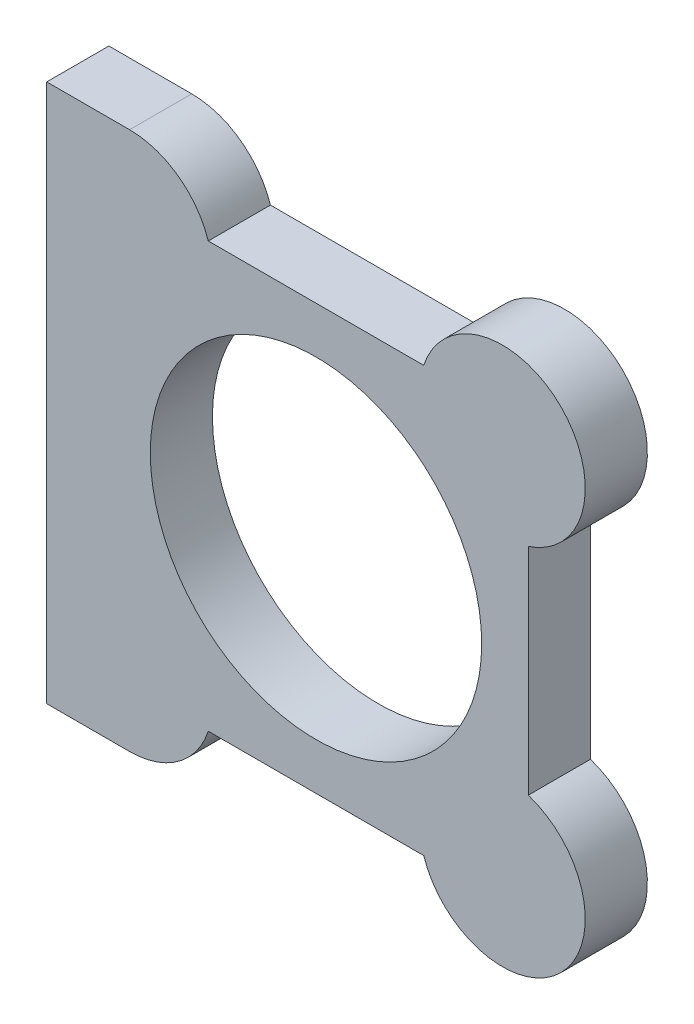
ISO-10303-21;
HEADER;
FILE_DESCRIPTION(('STEP AP214'),'2;1');
FILE_NAME('part.step','',(''),(''),'','','');
FILE_SCHEMA(('AUTOMOTIVE_DESIGN { 1 0 10303 214 1 1 1 1 }'));
ENDSEC;
DATA;
#1=APPLICATION_CONTEXT('core data for automotive mechanical design processes');
#2=APPLICATION_PROTOCOL_DEFINITION('international standard','automotive_design',2000,#1);
#3=PRODUCT_CONTEXT('',#1,'mechanical');
#4=PRODUCT('Part','Part','',(#3));
#5=PRODUCT_RELATED_PRODUCT_CATEGORY('part','',(#4));
#6=PRODUCT_DEFINITION_FORMATION('','',#4);
#7=PRODUCT_DEFINITION_CONTEXT('part definition',#1,'design');
#8=PRODUCT_DEFINITION('design','',#6,#7);
#9=PRODUCT_DEFINITION_SHAPE('','',#8);
#10=(LENGTH_UNIT() NAMED_UNIT(*) SI_UNIT(.MILLI.,.METRE.));
#11=(NAMED_UNIT(*) PLANE_ANGLE_UNIT() SI_UNIT($,.RADIAN.));
#12=(NAMED_UNIT(*) SI_UNIT($,.STERADIAN.) SOLID_ANGLE_UNIT());
#13=UNCERTAINTY_MEASURE_WITH_UNIT(LENGTH_MEASURE(1.E-05),#10,'distance_accuracy_value','');
#14=(GEOMETRIC_REPRESENTATION_CONTEXT(3) GLOBAL_UNCERTAINTY_ASSIGNED_CONTEXT((#13)) GLOBAL_UNIT_ASSIGNED_CONTEXT((#10,
#11,#12)) REPRESENTATION_CONTEXT('',''));
#15=CARTESIAN_POINT('',(0.,0.,0.));
#16=DIRECTION('',(0.,0.,1.));
#17=DIRECTION('',(1.,0.,0.));
#18=AXIS2_PLACEMENT_3D('',#15,#16,#17);
#19=CARTESIAN_POINT('',(0.,0.,6.));
#20=DIRECTION('',(0.,0.,-1.));
#21=DIRECTION('',(-1.,0.,0.));
#22=AXIS2_PLACEMENT_3D('',#19,#20,#21);
#23=PLANE('',#22);
#24=CARTESIAN_POINT('',(26.,26.,6.));
#25=DIRECTION('',(0.,0.,1.));
#26=DIRECTION('',(1.,0.,0.));
#27=AXIS2_PLACEMENT_3D('',#24,#25,#26);
#28=CIRCLE('',#27,16.);
#29=CARTESIAN_POINT('',(42.,26.,6.));
#30=VERTEX_POINT('',#29);
#31=EDGE_CURVE('E176',#30,#30,#28,.T.);
#32=ORIENTED_EDGE('',*,*,#31,.F.);
#33=EDGE_LOOP('',(#32));
#34=FACE_BOUND('',#33,.T.);
#35=CARTESIAN_POINT('',(8.,44.,6.));
#36=DIRECTION('',(0.,0.,1.));
#37=DIRECTION('',(1.,0.,0.));
#38=AXIS2_PLACEMENT_3D('',#35,#36,#37);
#39=CIRCLE('',#38,8.);
#40=CARTESIAN_POINT('',(15.6006640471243,46.4959779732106,6.));
#41=VERTEX_POINT('',#40);
#42=CARTESIAN_POINT('',(8.,52.,6.));
#43=VERTEX_POINT('',#42);
#44=EDGE_CURVE('E191',#41,#43,#39,.T.);
#45=ORIENTED_EDGE('',*,*,#44,.T.);
#46=DIRECTION('',(-1.,0.,0.));
#47=VECTOR('',#46,1.);
#48=CARTESIAN_POINT('',(0.,52.,6.));
#49=LINE('',#48,#47);
#50=CARTESIAN_POINT('',(0.,52.,6.));
#51=VERTEX_POINT('',#50);
#52=EDGE_CURVE('E61',#43,#51,#49,.T.);
#53=ORIENTED_EDGE('',*,*,#52,.T.);
#54=DIRECTION('',(0.,-1.,0.));
#55=VECTOR('',#54,1.);
#56=CARTESIAN_POINT('',(0.,0.,6.));
#57=LINE('',#56,#55);
#58=CARTESIAN_POINT('',(0.,0.,6.));
#59=VERTEX_POINT('',#58);
#60=EDGE_CURVE('E141',#51,#59,#57,.T.);
#61=ORIENTED_EDGE('',*,*,#60,.T.);
#62=DIRECTION('',(1.,0.,0.));
#63=VECTOR('',#62,1.);
#64=CARTESIAN_POINT('',(0.,0.,6.));
#65=LINE('',#64,#63);
#66=CARTESIAN_POINT('',(8.,0.,6.));
#67=VERTEX_POINT('',#66);
#68=EDGE_CURVE('E144',#59,#67,#65,.T.);
#69=ORIENTED_EDGE('',*,*,#68,.T.);
#70=CARTESIAN_POINT('',(8.,8.,6.));
#71=DIRECTION('',(0.,0.,1.));
#72=DIRECTION('',(1.,0.,0.));
#73=AXIS2_PLACEMENT_3D('',#70,#71,#72);
#74=CIRCLE('',#73,8.);
#75=CARTESIAN_POINT('',(15.5993420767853,5.5,6.));
#76=VERTEX_POINT('',#75);
#77=EDGE_CURVE('E125',#67,#76,#74,.T.);
#78=ORIENTED_EDGE('',*,*,#77,.T.);
#79=DIRECTION('',(1.,0.,0.));
#80=VECTOR('',#79,1.);
#81=CARTESIAN_POINT('',(0.,5.5,6.));
#82=LINE('',#81,#80);
#83=CARTESIAN_POINT('',(36.4006579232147,5.5,6.));
#84=VERTEX_POINT('',#83);
#85=EDGE_CURVE('E206',#76,#84,#82,.T.);
#86=ORIENTED_EDGE('',*,*,#85,.T.);
#87=CARTESIAN_POINT('',(44.,8.,6.));
#88=DIRECTION('',(0.,0.,1.));
#89=DIRECTION('',(1.,0.,0.));
#90=AXIS2_PLACEMENT_3D('',#87,#88,#89);
#91=CIRCLE('',#90,8.);
#92=CARTESIAN_POINT('',(46.5,15.5993420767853,6.));
#93=VERTEX_POINT('',#92);
#94=EDGE_CURVE('E136',#84,#93,#91,.T.);
#95=ORIENTED_EDGE('',*,*,#94,.T.);
#96=DIRECTION('',(0.,1.,0.));
#97=VECTOR('',#96,1.);
#98=CARTESIAN_POINT('',(46.5,0.,6.));
#99=LINE('',#98,#97);
#100=CARTESIAN_POINT('',(46.5,36.4006579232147,6.));
#101=VERTEX_POINT('',#100);
#102=EDGE_CURVE('E119',#93,#101,#99,.T.);
#103=ORIENTED_EDGE('',*,*,#102,.T.);
#104=CARTESIAN_POINT('',(44.,44.,6.));
#105=DIRECTION('',(0.,0.,1.));
#106=DIRECTION('',(1.,0.,0.));
#107=AXIS2_PLACEMENT_3D('',#104,#105,#106);
#108=CIRCLE('',#107,8.);
#109=CARTESIAN_POINT('',(36.3993359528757,46.4959779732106,6.));
#110=VERTEX_POINT('',#109);
#111=EDGE_CURVE('E82',#101,#110,#108,.T.);
#112=ORIENTED_EDGE('',*,*,#111,.T.);
#113=DIRECTION('',(1.,0.,0.));
#114=VECTOR('',#113,1.);
#115=CARTESIAN_POINT('',(0.,46.4959779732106,6.));
#116=LINE('',#115,#114);
#117=EDGE_CURVE('E187',#41,#110,#116,.T.);
#118=ORIENTED_EDGE('',*,*,#117,.F.);
#119=EDGE_LOOP('',(#45,#53,#61,#69,#78,#86,#95,#103,#112,#118));
#120=FACE_BOUND('',#119,.T.);
#121=ADVANCED_FACE('F43',(#34,#120),#23,.F.);
#122=CARTESIAN_POINT('',(0.,0.,0.));
#123=DIRECTION('',(0.,0.,-1.));
#124=DIRECTION('',(-1.,0.,0.));
#125=AXIS2_PLACEMENT_3D('',#122,#123,#124);
#126=PLANE('',#125);
#127=CARTESIAN_POINT('',(26.,26.,0.));
#128=DIRECTION('',(0.,0.,1.));
#129=DIRECTION('',(1.,0.,0.));
#130=AXIS2_PLACEMENT_3D('',#127,#128,#129);
#131=CIRCLE('',#130,16.);
#132=CARTESIAN_POINT('',(42.,26.,0.));
#133=VERTEX_POINT('',#132);
#134=EDGE_CURVE('E183',#133,#133,#131,.T.);
#135=ORIENTED_EDGE('',*,*,#134,.T.);
#136=EDGE_LOOP('',(#135));
#137=FACE_BOUND('',#136,.T.);
#138=DIRECTION('',(-1.,0.,0.));
#139=VECTOR('',#138,1.);
#140=CARTESIAN_POINT('',(0.,52.,0.));
#141=LINE('',#140,#139);
#142=CARTESIAN_POINT('',(8.,52.,0.));
#143=VERTEX_POINT('',#142);
#144=CARTESIAN_POINT('',(0.,52.,0.));
#145=VERTEX_POINT('',#144);
#146=EDGE_CURVE('E145',#143,#145,#141,.T.);
#147=ORIENTED_EDGE('',*,*,#146,.F.);
#148=CARTESIAN_POINT('',(8.,44.,0.));
#149=DIRECTION('',(0.,0.,1.));
#150=DIRECTION('',(1.,0.,0.));
#151=AXIS2_PLACEMENT_3D('',#148,#149,#150);
#152=CIRCLE('',#151,8.);
#153=CARTESIAN_POINT('',(15.6006640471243,46.4959779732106,0.));
#154=VERTEX_POINT('',#153);
#155=EDGE_CURVE('E128',#154,#143,#152,.T.);
#156=ORIENTED_EDGE('',*,*,#155,.F.);
#157=DIRECTION('',(1.,0.,0.));
#158=VECTOR('',#157,1.);
#159=CARTESIAN_POINT('',(0.,46.4959779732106,0.));
#160=LINE('',#159,#158);
#161=CARTESIAN_POINT('',(36.3993359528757,46.4959779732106,0.));
#162=VERTEX_POINT('',#161);
#163=EDGE_CURVE('E105',#154,#162,#160,.T.);
#164=ORIENTED_EDGE('',*,*,#163,.T.);
#165=CARTESIAN_POINT('',(44.,44.,0.));
#166=DIRECTION('',(0.,0.,1.));
#167=DIRECTION('',(1.,0.,0.));
#168=AXIS2_PLACEMENT_3D('',#165,#166,#167);
#169=CIRCLE('',#168,8.);
#170=CARTESIAN_POINT('',(46.5,36.4006579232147,0.));
#171=VERTEX_POINT('',#170);
#172=EDGE_CURVE('E96',#171,#162,#169,.T.);
#173=ORIENTED_EDGE('',*,*,#172,.F.);
#174=DIRECTION('',(0.,1.,0.));
#175=VECTOR('',#174,1.);
#176=CARTESIAN_POINT('',(46.5,0.,0.));
#177=LINE('',#176,#175);
#178=CARTESIAN_POINT('',(46.5,15.5993420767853,0.));
#179=VERTEX_POINT('',#178);
#180=EDGE_CURVE('E101',#179,#171,#177,.T.);
#181=ORIENTED_EDGE('',*,*,#180,.F.);
#182=CARTESIAN_POINT('',(44.,8.,0.));
#183=DIRECTION('',(0.,0.,1.));
#184=DIRECTION('',(1.,0.,0.));
#185=AXIS2_PLACEMENT_3D('',#182,#183,#184);
#186=CIRCLE('',#185,8.);
#187=CARTESIAN_POINT('',(36.4006579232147,5.5,0.));
#188=VERTEX_POINT('',#187);
#189=EDGE_CURVE('E132',#188,#179,#186,.T.);
#190=ORIENTED_EDGE('',*,*,#189,.F.);
#191=DIRECTION('',(1.,0.,0.));
#192=VECTOR('',#191,1.);
#193=CARTESIAN_POINT('',(0.,5.5,0.));
#194=LINE('',#193,#192);
#195=CARTESIAN_POINT('',(15.5993420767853,5.5,0.));
#196=VERTEX_POINT('',#195);
#197=EDGE_CURVE('E207',#196,#188,#194,.T.);
#198=ORIENTED_EDGE('',*,*,#197,.F.);
#199=CARTESIAN_POINT('',(8.,8.,0.));
#200=DIRECTION('',(0.,0.,1.));
#201=DIRECTION('',(1.,0.,0.));
#202=AXIS2_PLACEMENT_3D('',#199,#200,#201);
#203=CIRCLE('',#202,8.);
#204=CARTESIAN_POINT('',(8.,0.,0.));
#205=VERTEX_POINT('',#204);
#206=EDGE_CURVE('E202',#205,#196,#203,.T.);
#207=ORIENTED_EDGE('',*,*,#206,.F.);
#208=DIRECTION('',(1.,0.,0.));
#209=VECTOR('',#208,1.);
#210=CARTESIAN_POINT('',(0.,0.,0.));
#211=LINE('',#210,#209);
#212=CARTESIAN_POINT('',(0.,0.,0.));
#213=VERTEX_POINT('',#212);
#214=EDGE_CURVE('E73',#213,#205,#211,.T.);
#215=ORIENTED_EDGE('',*,*,#214,.F.);
#216=DIRECTION('',(0.,-1.,0.));
#217=VECTOR('',#216,1.);
#218=CARTESIAN_POINT('',(0.,0.,0.));
#219=LINE('',#218,#217);
#220=EDGE_CURVE('E108',#145,#213,#219,.T.);
#221=ORIENTED_EDGE('',*,*,#220,.F.);
#222=EDGE_LOOP('',(#147,#156,#164,#173,#181,#190,#198,#207,#215,#221));
#223=FACE_BOUND('',#222,.T.);
#224=ADVANCED_FACE('F99',(#137,#223),#126,.T.);
#225=CARTESIAN_POINT('',(0.,52.,6.));
#226=DIRECTION('',(0.,-1.,0.));
#227=DIRECTION('',(0.,0.,-1.));
#228=AXIS2_PLACEMENT_3D('',#225,#226,#227);
#229=PLANE('',#228);
#230=DIRECTION('',(0.,0.,1.));
#231=VECTOR('',#230,1.);
#232=CARTESIAN_POINT('',(8.,52.,0.));
#233=LINE('',#232,#231);
#234=EDGE_CURVE('E170',#143,#43,#233,.T.);
#235=ORIENTED_EDGE('',*,*,#234,.F.);
#236=ORIENTED_EDGE('',*,*,#146,.T.);
#237=DIRECTION('',(0.,0.,-1.));
#238=VECTOR('',#237,1.);
#239=CARTESIAN_POINT('',(0.,52.,6.));
#240=LINE('',#239,#238);
#241=EDGE_CURVE('E53',#51,#145,#240,.T.);
#242=ORIENTED_EDGE('',*,*,#241,.F.);
#243=ORIENTED_EDGE('',*,*,#52,.F.);
#244=EDGE_LOOP('',(#235,#236,#242,#243));
#245=FACE_BOUND('',#244,.T.);
#246=ADVANCED_FACE('F168',(#245),#229,.F.);
#247=CARTESIAN_POINT('',(0.,0.,6.));
#248=DIRECTION('',(1.,0.,0.));
#249=DIRECTION('',(0.,0.,-1.));
#250=AXIS2_PLACEMENT_3D('',#247,#248,#249);
#251=PLANE('',#250);
#252=ORIENTED_EDGE('',*,*,#220,.T.);
#253=DIRECTION('',(0.,0.,-1.));
#254=VECTOR('',#253,1.);
#255=CARTESIAN_POINT('',(0.,0.,6.));
#256=LINE('',#255,#254);
#257=EDGE_CURVE('E11',#59,#213,#256,.T.);
#258=ORIENTED_EDGE('',*,*,#257,.F.);
#259=ORIENTED_EDGE('',*,*,#60,.F.);
#260=ORIENTED_EDGE('',*,*,#241,.T.);
#261=EDGE_LOOP('',(#252,#258,#259,#260));
#262=FACE_BOUND('',#261,.T.);
#263=ADVANCED_FACE('F45',(#262),#251,.F.);
#264=CARTESIAN_POINT('',(0.,0.,6.));
#265=DIRECTION('',(0.,1.,0.));
#266=DIRECTION('',(0.,0.,1.));
#267=AXIS2_PLACEMENT_3D('',#264,#265,#266);
#268=PLANE('',#267);
#269=ORIENTED_EDGE('',*,*,#214,.T.);
#270=DIRECTION('',(0.,0.,1.));
#271=VECTOR('',#270,1.);
#272=CARTESIAN_POINT('',(8.,0.,0.));
#273=LINE('',#272,#271);
#274=EDGE_CURVE('E211',#205,#67,#273,.T.);
#275=ORIENTED_EDGE('',*,*,#274,.T.);
#276=ORIENTED_EDGE('',*,*,#68,.F.);
#277=ORIENTED_EDGE('',*,*,#257,.T.);
#278=EDGE_LOOP('',(#269,#275,#276,#277));
#279=FACE_BOUND('',#278,.T.);
#280=ADVANCED_FACE('F271',(#279),#268,.F.);
#281=CARTESIAN_POINT('',(44.,8.,0.));
#282=DIRECTION('',(0.,0.,1.));
#283=DIRECTION('',(1.,0.,0.));
#284=AXIS2_PLACEMENT_3D('',#281,#282,#283);
#285=CYLINDRICAL_SURFACE('',#284,8.);
#286=ORIENTED_EDGE('',*,*,#94,.F.);
#287=DIRECTION('',(0.,0.,1.));
#288=VECTOR('',#287,1.);
#289=CARTESIAN_POINT('',(36.4006579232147,5.5,0.));
#290=LINE('',#289,#288);
#291=EDGE_CURVE('E221',#188,#84,#290,.T.);
#292=ORIENTED_EDGE('',*,*,#291,.F.);
#293=ORIENTED_EDGE('',*,*,#189,.T.);
#294=DIRECTION('',(0.,0.,1.));
#295=VECTOR('',#294,1.);
#296=CARTESIAN_POINT('',(46.5,15.5993420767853,0.));
#297=LINE('',#296,#295);
#298=EDGE_CURVE('E117',#179,#93,#297,.T.);
#299=ORIENTED_EDGE('',*,*,#298,.T.);
#300=EDGE_LOOP('',(#286,#292,#293,#299));
#301=FACE_BOUND('',#300,.T.);
#302=ADVANCED_FACE('F273',(#301),#285,.T.);
#303=CARTESIAN_POINT('',(44.,44.,0.));
#304=DIRECTION('',(0.,0.,1.));
#305=DIRECTION('',(1.,0.,0.));
#306=AXIS2_PLACEMENT_3D('',#303,#304,#305);
#307=CYLINDRICAL_SURFACE('',#306,8.);
#308=ORIENTED_EDGE('',*,*,#111,.F.);
#309=DIRECTION('',(0.,0.,1.));
#310=VECTOR('',#309,1.);
#311=CARTESIAN_POINT('',(46.5,36.4006579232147,0.));
#312=LINE('',#311,#310);
#313=EDGE_CURVE('E114',#171,#101,#312,.T.);
#314=ORIENTED_EDGE('',*,*,#313,.F.);
#315=ORIENTED_EDGE('',*,*,#172,.T.);
#316=DIRECTION('',(0.,0.,1.));
#317=VECTOR('',#316,1.);
#318=CARTESIAN_POINT('',(36.3993359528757,46.4959779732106,0.));
#319=LINE('',#318,#317);
#320=EDGE_CURVE('E175',#162,#110,#319,.T.);
#321=ORIENTED_EDGE('',*,*,#320,.T.);
#322=EDGE_LOOP('',(#308,#314,#315,#321));
#323=FACE_BOUND('',#322,.T.);
#324=ADVANCED_FACE('F121',(#323),#307,.T.);
#325=CARTESIAN_POINT('',(46.5,0.,0.));
#326=DIRECTION('',(1.,0.,0.));
#327=DIRECTION('',(0.,0.,-1.));
#328=AXIS2_PLACEMENT_3D('',#325,#326,#327);
#329=PLANE('',#328);
#330=ORIENTED_EDGE('',*,*,#102,.F.);
#331=ORIENTED_EDGE('',*,*,#298,.F.);
#332=ORIENTED_EDGE('',*,*,#180,.T.);
#333=ORIENTED_EDGE('',*,*,#313,.T.);
#334=EDGE_LOOP('',(#330,#331,#332,#333));
#335=FACE_BOUND('',#334,.T.);
#336=ADVANCED_FACE('F113',(#335),#329,.T.);
#337=CARTESIAN_POINT('',(8.,44.,0.));
#338=DIRECTION('',(0.,0.,1.));
#339=DIRECTION('',(1.,0.,0.));
#340=AXIS2_PLACEMENT_3D('',#337,#338,#339);
#341=CYLINDRICAL_SURFACE('',#340,8.);
#342=ORIENTED_EDGE('',*,*,#44,.F.);
#343=DIRECTION('',(0.,0.,1.));
#344=VECTOR('',#343,1.);
#345=CARTESIAN_POINT('',(15.6006640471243,46.4959779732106,0.));
#346=LINE('',#345,#344);
#347=EDGE_CURVE('E180',#154,#41,#346,.T.);
#348=ORIENTED_EDGE('',*,*,#347,.F.);
#349=ORIENTED_EDGE('',*,*,#155,.T.);
#350=ORIENTED_EDGE('',*,*,#234,.T.);
#351=EDGE_LOOP('',(#342,#348,#349,#350));
#352=FACE_BOUND('',#351,.T.);
#353=ADVANCED_FACE('F246',(#352),#341,.T.);
#354=CARTESIAN_POINT('',(0.,46.4959779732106,0.));
#355=DIRECTION('',(0.,-1.,0.));
#356=DIRECTION('',(0.,0.,-1.));
#357=AXIS2_PLACEMENT_3D('',#354,#355,#356);
#358=PLANE('',#357);
#359=ORIENTED_EDGE('',*,*,#117,.T.);
#360=ORIENTED_EDGE('',*,*,#320,.F.);
#361=ORIENTED_EDGE('',*,*,#163,.F.);
#362=ORIENTED_EDGE('',*,*,#347,.T.);
#363=EDGE_LOOP('',(#359,#360,#361,#362));
#364=FACE_BOUND('',#363,.T.);
#365=ADVANCED_FACE('F274',(#364),#358,.F.);
#366=CARTESIAN_POINT('',(8.,8.,0.));
#367=DIRECTION('',(0.,0.,1.));
#368=DIRECTION('',(1.,0.,0.));
#369=AXIS2_PLACEMENT_3D('',#366,#367,#368);
#370=CYLINDRICAL_SURFACE('',#369,8.);
#371=ORIENTED_EDGE('',*,*,#77,.F.);
#372=ORIENTED_EDGE('',*,*,#274,.F.);
#373=ORIENTED_EDGE('',*,*,#206,.T.);
#374=DIRECTION('',(0.,0.,1.));
#375=VECTOR('',#374,1.);
#376=CARTESIAN_POINT('',(15.5993420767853,5.5,0.));
#377=LINE('',#376,#375);
#378=EDGE_CURVE('E193',#196,#76,#377,.T.);
#379=ORIENTED_EDGE('',*,*,#378,.T.);
#380=EDGE_LOOP('',(#371,#372,#373,#379));
#381=FACE_BOUND('',#380,.T.);
#382=ADVANCED_FACE('F238',(#381),#370,.T.);
#383=CARTESIAN_POINT('',(0.,5.5,0.));
#384=DIRECTION('',(0.,-1.,0.));
#385=DIRECTION('',(0.,0.,-1.));
#386=AXIS2_PLACEMENT_3D('',#383,#384,#385);
#387=PLANE('',#386);
#388=ORIENTED_EDGE('',*,*,#85,.F.);
#389=ORIENTED_EDGE('',*,*,#378,.F.);
#390=ORIENTED_EDGE('',*,*,#197,.T.);
#391=ORIENTED_EDGE('',*,*,#291,.T.);
#392=EDGE_LOOP('',(#388,#389,#390,#391));
#393=FACE_BOUND('',#392,.T.);
#394=ADVANCED_FACE('F236',(#393),#387,.T.);
#395=CARTESIAN_POINT('',(26.,26.,0.));
#396=DIRECTION('',(0.,0.,1.));
#397=DIRECTION('',(1.,0.,0.));
#398=AXIS2_PLACEMENT_3D('',#395,#396,#397);
#399=CYLINDRICAL_SURFACE('',#398,16.);
#400=ORIENTED_EDGE('',*,*,#134,.F.);
#401=EDGE_LOOP('',(#400));
#402=FACE_BOUND('',#401,.T.);
#403=ORIENTED_EDGE('',*,*,#31,.T.);
#404=EDGE_LOOP('',(#403));
#405=FACE_BOUND('',#404,.T.);
#406=ADVANCED_FACE('F233',(#402,#405),#399,.F.);
#407=CLOSED_SHELL('',(#121,#224,#246,#263,#280,#302,#324,#336,#353,#365,#382,#394,#406));
#408=MANIFOLD_SOLID_BREP('B2',#407);
#409=ADVANCED_BREP_SHAPE_REPRESENTATION('',(#18,#408),#14);
#410=SHAPE_DEFINITION_REPRESENTATION(#9,#409);
ENDSEC;
END-ISO-10303-21;
